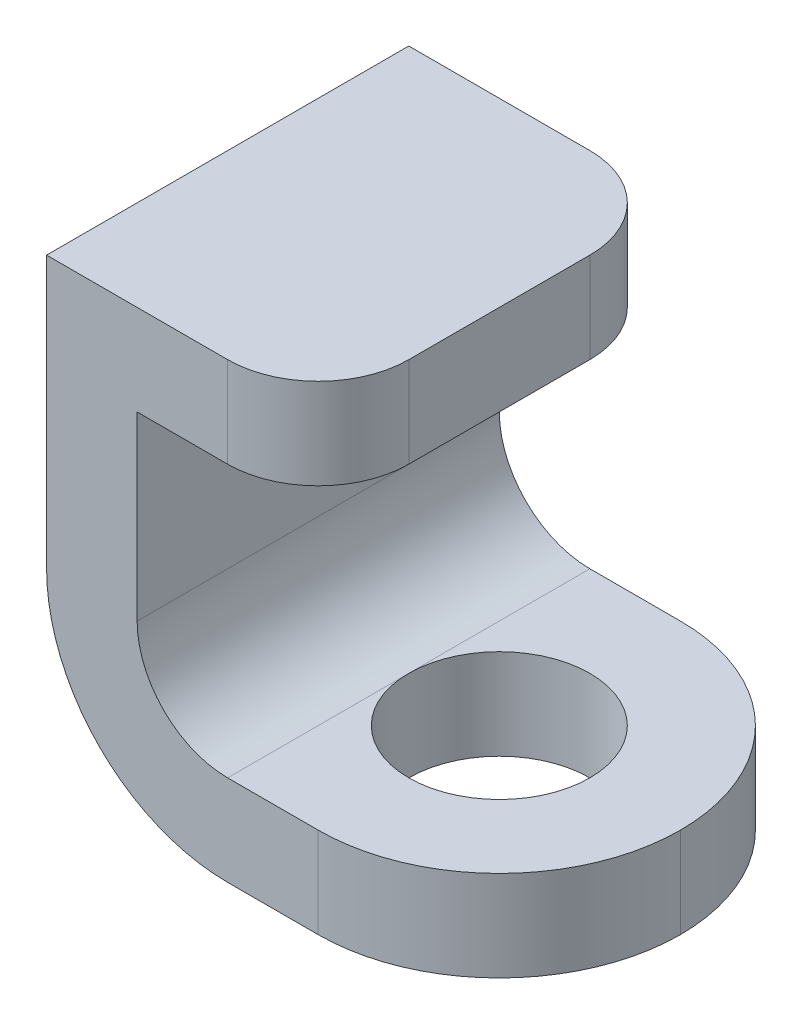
ISO-10303-21;
HEADER;
FILE_DESCRIPTION(('STEP AP214'),'2;1');
FILE_NAME('part.step','',(''),(''),'','','');
FILE_SCHEMA(('AUTOMOTIVE_DESIGN { 1 0 10303 214 1 1 1 1 }'));
ENDSEC;
DATA;
#1=APPLICATION_CONTEXT('core data for automotive mechanical design processes');
#2=APPLICATION_PROTOCOL_DEFINITION('international standard','automotive_design',2000,#1);
#3=PRODUCT_CONTEXT('',#1,'mechanical');
#4=PRODUCT('Part','Part','',(#3));
#5=PRODUCT_RELATED_PRODUCT_CATEGORY('part','',(#4));
#6=PRODUCT_DEFINITION_FORMATION('','',#4);
#7=PRODUCT_DEFINITION_CONTEXT('part definition',#1,'design');
#8=PRODUCT_DEFINITION('design','',#6,#7);
#9=PRODUCT_DEFINITION_SHAPE('','',#8);
#10=(LENGTH_UNIT() NAMED_UNIT(*) SI_UNIT(.MILLI.,.METRE.));
#11=(NAMED_UNIT(*) PLANE_ANGLE_UNIT() SI_UNIT($,.RADIAN.));
#12=(NAMED_UNIT(*) SI_UNIT($,.STERADIAN.) SOLID_ANGLE_UNIT());
#13=UNCERTAINTY_MEASURE_WITH_UNIT(LENGTH_MEASURE(1.E-05),#10,'distance_accuracy_value','');
#14=(GEOMETRIC_REPRESENTATION_CONTEXT(3) GLOBAL_UNCERTAINTY_ASSIGNED_CONTEXT((#13)) GLOBAL_UNIT_ASSIGNED_CONTEXT((#10,
#11,#12)) REPRESENTATION_CONTEXT('',''));
#15=CARTESIAN_POINT('',(0.,0.,0.));
#16=DIRECTION('',(0.,0.,1.));
#17=DIRECTION('',(1.,0.,0.));
#18=AXIS2_PLACEMENT_3D('',#15,#16,#17);
#19=CARTESIAN_POINT('',(-50.,40.,20.));
#20=DIRECTION('',(0.,1.,0.));
#21=DIRECTION('',(0.,0.,1.));
#22=AXIS2_PLACEMENT_3D('',#19,#20,#21);
#23=PLANE('',#22);
#24=DIRECTION('',(1.,0.,0.));
#25=VECTOR('',#24,1.);
#26=CARTESIAN_POINT('',(-50.,40.,-20.));
#27=LINE('',#26,#25);
#28=CARTESIAN_POINT('',(-40.,40.,-20.));
#29=VERTEX_POINT('',#28);
#30=CARTESIAN_POINT('',(-30.,40.,-20.));
#31=VERTEX_POINT('',#30);
#32=EDGE_CURVE('E171',#29,#31,#27,.T.);
#33=ORIENTED_EDGE('',*,*,#32,.T.);
#34=CARTESIAN_POINT('',(-30.,40.,-10.));
#35=DIRECTION('',(0.,1.,0.));
#36=DIRECTION('',(0.,0.,1.));
#37=AXIS2_PLACEMENT_3D('',#34,#35,#36);
#38=CIRCLE('',#37,10.);
#39=CARTESIAN_POINT('',(-20.,40.,-10.));
#40=VERTEX_POINT('',#39);
#41=EDGE_CURVE('E213',#31,#40,#38,.F.);
#42=ORIENTED_EDGE('',*,*,#41,.T.);
#43=DIRECTION('',(0.,0.,-1.));
#44=VECTOR('',#43,1.);
#45=CARTESIAN_POINT('',(-20.,40.,20.));
#46=LINE('',#45,#44);
#47=CARTESIAN_POINT('',(-20.,40.,10.));
#48=VERTEX_POINT('',#47);
#49=EDGE_CURVE('E205',#48,#40,#46,.T.);
#50=ORIENTED_EDGE('',*,*,#49,.F.);
#51=CARTESIAN_POINT('',(-30.,40.,10.));
#52=DIRECTION('',(0.,1.,0.));
#53=DIRECTION('',(0.,0.,1.));
#54=AXIS2_PLACEMENT_3D('',#51,#52,#53);
#55=CIRCLE('',#54,10.);
#56=CARTESIAN_POINT('',(-30.,40.,20.));
#57=VERTEX_POINT('',#56);
#58=EDGE_CURVE('E211',#48,#57,#55,.F.);
#59=ORIENTED_EDGE('',*,*,#58,.T.);
#60=DIRECTION('',(1.,0.,0.));
#61=VECTOR('',#60,1.);
#62=CARTESIAN_POINT('',(-50.,40.,20.));
#63=LINE('',#62,#61);
#64=CARTESIAN_POINT('',(-40.,40.,20.));
#65=VERTEX_POINT('',#64);
#66=EDGE_CURVE('E154',#65,#57,#63,.T.);
#67=ORIENTED_EDGE('',*,*,#66,.F.);
#68=DIRECTION('',(0.,0.,-1.));
#69=VECTOR('',#68,1.);
#70=CARTESIAN_POINT('',(-40.,40.,20.));
#71=LINE('',#70,#69);
#72=EDGE_CURVE('E170',#65,#29,#71,.T.);
#73=ORIENTED_EDGE('',*,*,#72,.T.);
#74=EDGE_LOOP('',(#33,#42,#50,#59,#67,#73));
#75=FACE_BOUND('',#74,.T.);
#76=ADVANCED_FACE('F30',(#75),#23,.F.);
#77=CARTESIAN_POINT('',(-20.,50.,20.));
#78=DIRECTION('',(1.,0.,0.));
#79=DIRECTION('',(0.,0.,-1.));
#80=AXIS2_PLACEMENT_3D('',#77,#78,#79);
#81=PLANE('',#80);
#82=ORIENTED_EDGE('',*,*,#49,.T.);
#83=DIRECTION('',(0.,-1.,0.));
#84=VECTOR('',#83,1.);
#85=CARTESIAN_POINT('',(-20.,50.,-10.));
#86=LINE('',#85,#84);
#87=CARTESIAN_POINT('',(-20.,50.,-10.));
#88=VERTEX_POINT('',#87);
#89=EDGE_CURVE('E218',#40,#88,#86,.F.);
#90=ORIENTED_EDGE('',*,*,#89,.T.);
#91=DIRECTION('',(0.,0.,-1.));
#92=VECTOR('',#91,1.);
#93=CARTESIAN_POINT('',(-20.,50.,20.));
#94=LINE('',#93,#92);
#95=CARTESIAN_POINT('',(-20.,50.,10.));
#96=VERTEX_POINT('',#95);
#97=EDGE_CURVE('E141',#96,#88,#94,.T.);
#98=ORIENTED_EDGE('',*,*,#97,.F.);
#99=DIRECTION('',(0.,-1.,0.));
#100=VECTOR('',#99,1.);
#101=CARTESIAN_POINT('',(-20.,40.,10.));
#102=LINE('',#101,#100);
#103=EDGE_CURVE('E215',#96,#48,#102,.T.);
#104=ORIENTED_EDGE('',*,*,#103,.T.);
#105=EDGE_LOOP('',(#82,#90,#98,#104));
#106=FACE_BOUND('',#105,.T.);
#107=ADVANCED_FACE('F276',(#106),#81,.T.);
#108=CARTESIAN_POINT('',(-50.,50.,20.));
#109=DIRECTION('',(0.,1.,0.));
#110=DIRECTION('',(0.,0.,1.));
#111=AXIS2_PLACEMENT_3D('',#108,#109,#110);
#112=PLANE('',#111);
#113=ORIENTED_EDGE('',*,*,#97,.T.);
#114=CARTESIAN_POINT('',(-30.,50.,-10.));
#115=DIRECTION('',(0.,1.,0.));
#116=DIRECTION('',(0.,0.,1.));
#117=AXIS2_PLACEMENT_3D('',#114,#115,#116);
#118=CIRCLE('',#117,10.);
#119=CARTESIAN_POINT('',(-30.,50.,-20.));
#120=VERTEX_POINT('',#119);
#121=EDGE_CURVE('E222',#88,#120,#118,.T.);
#122=ORIENTED_EDGE('',*,*,#121,.T.);
#123=DIRECTION('',(1.,0.,0.));
#124=VECTOR('',#123,1.);
#125=CARTESIAN_POINT('',(-50.,50.,-20.));
#126=LINE('',#125,#124);
#127=CARTESIAN_POINT('',(-50.,50.,-20.));
#128=VERTEX_POINT('',#127);
#129=EDGE_CURVE('E136',#128,#120,#126,.T.);
#130=ORIENTED_EDGE('',*,*,#129,.F.);
#131=DIRECTION('',(0.,0.,-1.));
#132=VECTOR('',#131,1.);
#133=CARTESIAN_POINT('',(-50.,50.,20.));
#134=LINE('',#133,#132);
#135=CARTESIAN_POINT('',(-50.,50.,20.));
#136=VERTEX_POINT('',#135);
#137=EDGE_CURVE('E129',#136,#128,#134,.T.);
#138=ORIENTED_EDGE('',*,*,#137,.F.);
#139=DIRECTION('',(1.,0.,0.));
#140=VECTOR('',#139,1.);
#141=CARTESIAN_POINT('',(-50.,50.,20.));
#142=LINE('',#141,#140);
#143=CARTESIAN_POINT('',(-30.,50.,20.));
#144=VERTEX_POINT('',#143);
#145=EDGE_CURVE('E133',#136,#144,#142,.T.);
#146=ORIENTED_EDGE('',*,*,#145,.T.);
#147=CARTESIAN_POINT('',(-30.,50.,10.));
#148=DIRECTION('',(0.,1.,0.));
#149=DIRECTION('',(0.,0.,1.));
#150=AXIS2_PLACEMENT_3D('',#147,#148,#149);
#151=CIRCLE('',#150,10.);
#152=EDGE_CURVE('E220',#144,#96,#151,.T.);
#153=ORIENTED_EDGE('',*,*,#152,.T.);
#154=EDGE_LOOP('',(#113,#122,#130,#138,#146,#153));
#155=FACE_BOUND('',#154,.T.);
#156=ADVANCED_FACE('F132',(#155),#112,.T.);
#157=CARTESIAN_POINT('',(-50.,20.,20.));
#158=DIRECTION('',(-1.,0.,0.));
#159=DIRECTION('',(0.,0.,1.));
#160=AXIS2_PLACEMENT_3D('',#157,#158,#159);
#161=PLANE('',#160);
#162=DIRECTION('',(0.,1.,0.));
#163=VECTOR('',#162,1.);
#164=CARTESIAN_POINT('',(-50.,20.,-20.));
#165=LINE('',#164,#163);
#166=CARTESIAN_POINT('',(-50.,20.,-20.));
#167=VERTEX_POINT('',#166);
#168=EDGE_CURVE('E175',#167,#128,#165,.T.);
#169=ORIENTED_EDGE('',*,*,#168,.F.);
#170=DIRECTION('',(0.,0.,-1.));
#171=VECTOR('',#170,1.);
#172=CARTESIAN_POINT('',(-50.,20.,20.));
#173=LINE('',#172,#171);
#174=CARTESIAN_POINT('',(-50.,20.,20.));
#175=VERTEX_POINT('',#174);
#176=EDGE_CURVE('E142',#175,#167,#173,.T.);
#177=ORIENTED_EDGE('',*,*,#176,.F.);
#178=DIRECTION('',(0.,1.,0.));
#179=VECTOR('',#178,1.);
#180=CARTESIAN_POINT('',(-50.,20.,20.));
#181=LINE('',#180,#179);
#182=EDGE_CURVE('E149',#175,#136,#181,.T.);
#183=ORIENTED_EDGE('',*,*,#182,.T.);
#184=ORIENTED_EDGE('',*,*,#137,.T.);
#185=EDGE_LOOP('',(#169,#177,#183,#184));
#186=FACE_BOUND('',#185,.T.);
#187=ADVANCED_FACE('F156',(#186),#161,.T.);
#188=CARTESIAN_POINT('',(-30.,20.,20.));
#189=DIRECTION('',(0.,0.,-1.));
#190=DIRECTION('',(-1.,0.,0.));
#191=AXIS2_PLACEMENT_3D('',#188,#189,#190);
#192=CYLINDRICAL_SURFACE('',#191,20.);
#193=CARTESIAN_POINT('',(-30.,20.,-20.));
#194=DIRECTION('',(0.,0.,-1.));
#195=DIRECTION('',(-1.,0.,0.));
#196=AXIS2_PLACEMENT_3D('',#193,#194,#195);
#197=CIRCLE('',#196,20.);
#198=CARTESIAN_POINT('',(-30.,0.,-20.));
#199=VERTEX_POINT('',#198);
#200=EDGE_CURVE('E177',#199,#167,#197,.T.);
#201=ORIENTED_EDGE('',*,*,#200,.F.);
#202=DIRECTION('',(0.,0.,-1.));
#203=VECTOR('',#202,1.);
#204=CARTESIAN_POINT('',(-30.,0.,20.));
#205=LINE('',#204,#203);
#206=CARTESIAN_POINT('',(-30.,0.,0.));
#207=VERTEX_POINT('',#206);
#208=EDGE_CURVE('E199',#207,#199,#205,.T.);
#209=ORIENTED_EDGE('',*,*,#208,.F.);
#210=CARTESIAN_POINT('',(-30.,0.,20.));
#211=VERTEX_POINT('',#210);
#212=EDGE_CURVE('E200',#211,#207,#205,.T.);
#213=ORIENTED_EDGE('',*,*,#212,.F.);
#214=CARTESIAN_POINT('',(-30.,20.,20.));
#215=DIRECTION('',(0.,0.,-1.));
#216=DIRECTION('',(-1.,0.,0.));
#217=AXIS2_PLACEMENT_3D('',#214,#215,#216);
#218=CIRCLE('',#217,20.);
#219=EDGE_CURVE('E157',#211,#175,#218,.T.);
#220=ORIENTED_EDGE('',*,*,#219,.T.);
#221=ORIENTED_EDGE('',*,*,#176,.T.);
#222=EDGE_LOOP('',(#201,#209,#213,#220,#221));
#223=FACE_BOUND('',#222,.T.);
#224=ADVANCED_FACE('F285',(#223),#192,.T.);
#225=CARTESIAN_POINT('',(0.,0.,20.));
#226=DIRECTION('',(0.,-1.,0.));
#227=DIRECTION('',(0.,0.,-1.));
#228=AXIS2_PLACEMENT_3D('',#225,#226,#227);
#229=PLANE('',#228);
#230=ORIENTED_EDGE('',*,*,#212,.T.);
#231=CARTESIAN_POINT('',(-20.,0.,0.));
#232=DIRECTION('',(0.,-1.,0.));
#233=DIRECTION('',(0.,0.,-1.));
#234=AXIS2_PLACEMENT_3D('',#231,#232,#233);
#235=CIRCLE('',#234,10.);
#236=EDGE_CURVE('E44',#207,#207,#235,.T.);
#237=ORIENTED_EDGE('',*,*,#236,.F.);
#238=ORIENTED_EDGE('',*,*,#208,.T.);
#239=DIRECTION('',(-1.,0.,0.));
#240=VECTOR('',#239,1.);
#241=CARTESIAN_POINT('',(0.,0.,-20.));
#242=LINE('',#241,#240);
#243=CARTESIAN_POINT('',(-20.,0.,-20.));
#244=VERTEX_POINT('',#243);
#245=EDGE_CURVE('E180',#244,#199,#242,.T.);
#246=ORIENTED_EDGE('',*,*,#245,.F.);
#247=CARTESIAN_POINT('',(-20.,0.,0.));
#248=DIRECTION('',(0.,-1.,0.));
#249=DIRECTION('',(0.,0.,-1.));
#250=AXIS2_PLACEMENT_3D('',#247,#248,#249);
#251=CIRCLE('',#250,20.);
#252=CARTESIAN_POINT('',(0.,0.,0.));
#253=VERTEX_POINT('',#252);
#254=EDGE_CURVE('E230',#244,#253,#251,.T.);
#255=ORIENTED_EDGE('',*,*,#254,.T.);
#256=CARTESIAN_POINT('',(-20.,0.,0.));
#257=DIRECTION('',(0.,-1.,0.));
#258=DIRECTION('',(0.,0.,-1.));
#259=AXIS2_PLACEMENT_3D('',#256,#257,#258);
#260=CIRCLE('',#259,20.);
#261=CARTESIAN_POINT('',(-20.,0.,20.));
#262=VERTEX_POINT('',#261);
#263=EDGE_CURVE('E228',#253,#262,#260,.T.);
#264=ORIENTED_EDGE('',*,*,#263,.T.);
#265=DIRECTION('',(-1.,0.,0.));
#266=VECTOR('',#265,1.);
#267=CARTESIAN_POINT('',(0.,0.,20.));
#268=LINE('',#267,#266);
#269=EDGE_CURVE('E159',#262,#211,#268,.T.);
#270=ORIENTED_EDGE('',*,*,#269,.T.);
#271=EDGE_LOOP('',(#230,#237,#238,#246,#255,#264,#270));
#272=FACE_BOUND('',#271,.T.);
#273=ADVANCED_FACE('F253',(#272),#229,.T.);
#274=CARTESIAN_POINT('',(0.,10.,20.));
#275=DIRECTION('',(0.,-1.,0.));
#276=DIRECTION('',(0.,0.,-1.));
#277=AXIS2_PLACEMENT_3D('',#274,#275,#276);
#278=PLANE('',#277);
#279=DIRECTION('',(0.,0.,-1.));
#280=VECTOR('',#279,1.);
#281=CARTESIAN_POINT('',(-30.,10.,20.));
#282=LINE('',#281,#280);
#283=CARTESIAN_POINT('',(-30.,10.,0.));
#284=VERTEX_POINT('',#283);
#285=CARTESIAN_POINT('',(-30.,10.,-20.));
#286=VERTEX_POINT('',#285);
#287=EDGE_CURVE('E195',#284,#286,#282,.T.);
#288=ORIENTED_EDGE('',*,*,#287,.F.);
#289=CARTESIAN_POINT('',(-20.,10.,0.));
#290=DIRECTION('',(0.,-1.,0.));
#291=DIRECTION('',(0.,0.,-1.));
#292=AXIS2_PLACEMENT_3D('',#289,#290,#291);
#293=CIRCLE('',#292,10.);
#294=EDGE_CURVE('E49',#284,#284,#293,.T.);
#295=ORIENTED_EDGE('',*,*,#294,.T.);
#296=CARTESIAN_POINT('',(-30.,10.,20.));
#297=VERTEX_POINT('',#296);
#298=EDGE_CURVE('E196',#297,#284,#282,.T.);
#299=ORIENTED_EDGE('',*,*,#298,.F.);
#300=DIRECTION('',(1.,0.,0.));
#301=VECTOR('',#300,1.);
#302=CARTESIAN_POINT('',(0.,10.,20.));
#303=LINE('',#302,#301);
#304=CARTESIAN_POINT('',(-20.,10.,20.));
#305=VERTEX_POINT('',#304);
#306=EDGE_CURVE('E164',#305,#297,#303,.F.);
#307=ORIENTED_EDGE('',*,*,#306,.F.);
#308=CARTESIAN_POINT('',(-20.,10.,0.));
#309=DIRECTION('',(0.,-1.,0.));
#310=DIRECTION('',(0.,0.,-1.));
#311=AXIS2_PLACEMENT_3D('',#308,#309,#310);
#312=CIRCLE('',#311,20.);
#313=CARTESIAN_POINT('',(0.,10.,0.));
#314=VERTEX_POINT('',#313);
#315=EDGE_CURVE('E232',#305,#314,#312,.F.);
#316=ORIENTED_EDGE('',*,*,#315,.T.);
#317=CARTESIAN_POINT('',(-20.,10.,0.));
#318=DIRECTION('',(0.,-1.,0.));
#319=DIRECTION('',(0.,0.,-1.));
#320=AXIS2_PLACEMENT_3D('',#317,#318,#319);
#321=CIRCLE('',#320,20.);
#322=CARTESIAN_POINT('',(-20.,10.,-20.));
#323=VERTEX_POINT('',#322);
#324=EDGE_CURVE('E39',#314,#323,#321,.F.);
#325=ORIENTED_EDGE('',*,*,#324,.T.);
#326=DIRECTION('',(1.,0.,0.));
#327=VECTOR('',#326,1.);
#328=CARTESIAN_POINT('',(0.,10.,-20.));
#329=LINE('',#328,#327);
#330=EDGE_CURVE('E183',#323,#286,#329,.F.);
#331=ORIENTED_EDGE('',*,*,#330,.T.);
#332=EDGE_LOOP('',(#288,#295,#299,#307,#316,#325,#331));
#333=FACE_BOUND('',#332,.T.);
#334=ADVANCED_FACE('F238',(#333),#278,.F.);
#335=CARTESIAN_POINT('',(-30.,20.,20.));
#336=DIRECTION('',(0.,0.,-1.));
#337=DIRECTION('',(-1.,0.,0.));
#338=AXIS2_PLACEMENT_3D('',#335,#336,#337);
#339=CYLINDRICAL_SURFACE('',#338,10.);
#340=CARTESIAN_POINT('',(-30.,20.,-20.));
#341=DIRECTION('',(0.,0.,1.));
#342=DIRECTION('',(1.,0.,0.));
#343=AXIS2_PLACEMENT_3D('',#340,#341,#342);
#344=CIRCLE('',#343,10.);
#345=CARTESIAN_POINT('',(-40.,20.,-20.));
#346=VERTEX_POINT('',#345);
#347=EDGE_CURVE('E186',#286,#346,#344,.F.);
#348=ORIENTED_EDGE('',*,*,#347,.T.);
#349=DIRECTION('',(0.,0.,-1.));
#350=VECTOR('',#349,1.);
#351=CARTESIAN_POINT('',(-40.,20.,20.));
#352=LINE('',#351,#350);
#353=CARTESIAN_POINT('',(-40.,20.,20.));
#354=VERTEX_POINT('',#353);
#355=EDGE_CURVE('E192',#354,#346,#352,.T.);
#356=ORIENTED_EDGE('',*,*,#355,.F.);
#357=CARTESIAN_POINT('',(-30.,20.,20.));
#358=DIRECTION('',(0.,0.,1.));
#359=DIRECTION('',(1.,0.,0.));
#360=AXIS2_PLACEMENT_3D('',#357,#358,#359);
#361=CIRCLE('',#360,10.);
#362=EDGE_CURVE('E166',#297,#354,#361,.F.);
#363=ORIENTED_EDGE('',*,*,#362,.F.);
#364=ORIENTED_EDGE('',*,*,#298,.T.);
#365=ORIENTED_EDGE('',*,*,#287,.T.);
#366=EDGE_LOOP('',(#348,#356,#363,#364,#365));
#367=FACE_BOUND('',#366,.T.);
#368=ADVANCED_FACE('F260',(#367),#339,.F.);
#369=CARTESIAN_POINT('',(-40.,20.,20.));
#370=DIRECTION('',(-1.,0.,0.));
#371=DIRECTION('',(0.,0.,1.));
#372=AXIS2_PLACEMENT_3D('',#369,#370,#371);
#373=PLANE('',#372);
#374=DIRECTION('',(0.,1.,0.));
#375=VECTOR('',#374,1.);
#376=CARTESIAN_POINT('',(-40.,20.,-20.));
#377=LINE('',#376,#375);
#378=EDGE_CURVE('E188',#346,#29,#377,.T.);
#379=ORIENTED_EDGE('',*,*,#378,.T.);
#380=ORIENTED_EDGE('',*,*,#72,.F.);
#381=DIRECTION('',(0.,1.,0.));
#382=VECTOR('',#381,1.);
#383=CARTESIAN_POINT('',(-40.,20.,20.));
#384=LINE('',#383,#382);
#385=EDGE_CURVE('E168',#354,#65,#384,.T.);
#386=ORIENTED_EDGE('',*,*,#385,.F.);
#387=ORIENTED_EDGE('',*,*,#355,.T.);
#388=EDGE_LOOP('',(#379,#380,#386,#387));
#389=FACE_BOUND('',#388,.T.);
#390=ADVANCED_FACE('F265',(#389),#373,.F.);
#391=CARTESIAN_POINT('',(-30.,20.,20.));
#392=DIRECTION('',(0.,0.,-1.));
#393=DIRECTION('',(-1.,0.,0.));
#394=AXIS2_PLACEMENT_3D('',#391,#392,#393);
#395=PLANE('',#394);
#396=ORIENTED_EDGE('',*,*,#269,.F.);
#397=DIRECTION('',(0.,-1.,0.));
#398=VECTOR('',#397,1.);
#399=CARTESIAN_POINT('',(-20.,10.,20.));
#400=LINE('',#399,#398);
#401=EDGE_CURVE('E11',#262,#305,#400,.F.);
#402=ORIENTED_EDGE('',*,*,#401,.T.);
#403=ORIENTED_EDGE('',*,*,#306,.T.);
#404=ORIENTED_EDGE('',*,*,#362,.T.);
#405=ORIENTED_EDGE('',*,*,#385,.T.);
#406=ORIENTED_EDGE('',*,*,#66,.T.);
#407=DIRECTION('',(0.,-1.,0.));
#408=VECTOR('',#407,1.);
#409=CARTESIAN_POINT('',(-30.,50.,20.));
#410=LINE('',#409,#408);
#411=EDGE_CURVE('E153',#57,#144,#410,.F.);
#412=ORIENTED_EDGE('',*,*,#411,.T.);
#413=ORIENTED_EDGE('',*,*,#145,.F.);
#414=ORIENTED_EDGE('',*,*,#182,.F.);
#415=ORIENTED_EDGE('',*,*,#219,.F.);
#416=EDGE_LOOP('',(#396,#402,#403,#404,#405,#406,#412,#413,#414,#415));
#417=FACE_BOUND('',#416,.T.);
#418=ADVANCED_FACE('F147',(#417),#395,.F.);
#419=CARTESIAN_POINT('',(-30.,20.,-20.));
#420=DIRECTION('',(0.,0.,-1.));
#421=DIRECTION('',(-1.,0.,0.));
#422=AXIS2_PLACEMENT_3D('',#419,#420,#421);
#423=PLANE('',#422);
#424=ORIENTED_EDGE('',*,*,#330,.F.);
#425=DIRECTION('',(0.,-1.,0.));
#426=VECTOR('',#425,1.);
#427=CARTESIAN_POINT('',(-20.,20.,-20.));
#428=LINE('',#427,#426);
#429=EDGE_CURVE('E225',#323,#244,#428,.T.);
#430=ORIENTED_EDGE('',*,*,#429,.T.);
#431=ORIENTED_EDGE('',*,*,#245,.T.);
#432=ORIENTED_EDGE('',*,*,#200,.T.);
#433=ORIENTED_EDGE('',*,*,#168,.T.);
#434=ORIENTED_EDGE('',*,*,#129,.T.);
#435=DIRECTION('',(0.,-1.,0.));
#436=VECTOR('',#435,1.);
#437=CARTESIAN_POINT('',(-30.,20.,-20.));
#438=LINE('',#437,#436);
#439=EDGE_CURVE('E208',#120,#31,#438,.T.);
#440=ORIENTED_EDGE('',*,*,#439,.T.);
#441=ORIENTED_EDGE('',*,*,#32,.F.);
#442=ORIENTED_EDGE('',*,*,#378,.F.);
#443=ORIENTED_EDGE('',*,*,#347,.F.);
#444=EDGE_LOOP('',(#424,#430,#431,#432,#433,#434,#440,#441,#442,#443));
#445=FACE_BOUND('',#444,.T.);
#446=ADVANCED_FACE('F247',(#445),#423,.T.);
#447=CARTESIAN_POINT('',(-30.,20.,-10.));
#448=DIRECTION('',(0.,-1.,0.));
#449=DIRECTION('',(0.,0.,-1.));
#450=AXIS2_PLACEMENT_3D('',#447,#448,#449);
#451=CYLINDRICAL_SURFACE('',#450,10.);
#452=ORIENTED_EDGE('',*,*,#121,.F.);
#453=ORIENTED_EDGE('',*,*,#89,.F.);
#454=ORIENTED_EDGE('',*,*,#41,.F.);
#455=ORIENTED_EDGE('',*,*,#439,.F.);
#456=EDGE_LOOP('',(#452,#453,#454,#455));
#457=FACE_BOUND('',#456,.T.);
#458=ADVANCED_FACE('F281',(#457),#451,.T.);
#459=CARTESIAN_POINT('',(-30.,50.,10.));
#460=DIRECTION('',(0.,1.,0.));
#461=DIRECTION('',(0.,0.,1.));
#462=AXIS2_PLACEMENT_3D('',#459,#460,#461);
#463=CYLINDRICAL_SURFACE('',#462,10.);
#464=ORIENTED_EDGE('',*,*,#152,.F.);
#465=ORIENTED_EDGE('',*,*,#411,.F.);
#466=ORIENTED_EDGE('',*,*,#58,.F.);
#467=ORIENTED_EDGE('',*,*,#103,.F.);
#468=EDGE_LOOP('',(#464,#465,#466,#467));
#469=FACE_BOUND('',#468,.T.);
#470=ADVANCED_FACE('F273',(#469),#463,.T.);
#471=CARTESIAN_POINT('',(-20.,10.,0.));
#472=DIRECTION('',(0.,1.,0.));
#473=DIRECTION('',(0.,0.,1.));
#474=AXIS2_PLACEMENT_3D('',#471,#472,#473);
#475=CYLINDRICAL_SURFACE('',#474,20.);
#476=DIRECTION('',(0.,-1.,0.));
#477=VECTOR('',#476,1.);
#478=CARTESIAN_POINT('',(0.,0.,0.));
#479=LINE('',#478,#477);
#480=EDGE_CURVE('E34',#314,#253,#479,.T.);
#481=ORIENTED_EDGE('',*,*,#480,.F.);
#482=ORIENTED_EDGE('',*,*,#315,.F.);
#483=ORIENTED_EDGE('',*,*,#401,.F.);
#484=ORIENTED_EDGE('',*,*,#263,.F.);
#485=EDGE_LOOP('',(#481,#482,#483,#484));
#486=FACE_BOUND('',#485,.T.);
#487=ADVANCED_FACE('F32',(#486),#475,.T.);
#488=CARTESIAN_POINT('',(-20.,20.,0.));
#489=DIRECTION('',(0.,-1.,0.));
#490=DIRECTION('',(0.,0.,-1.));
#491=AXIS2_PLACEMENT_3D('',#488,#489,#490);
#492=CYLINDRICAL_SURFACE('',#491,20.);
#493=ORIENTED_EDGE('',*,*,#324,.F.);
#494=ORIENTED_EDGE('',*,*,#480,.T.);
#495=ORIENTED_EDGE('',*,*,#254,.F.);
#496=ORIENTED_EDGE('',*,*,#429,.F.);
#497=EDGE_LOOP('',(#493,#494,#495,#496));
#498=FACE_BOUND('',#497,.T.);
#499=ADVANCED_FACE('F250',(#498),#492,.T.);
#500=CARTESIAN_POINT('',(-20.,10.,0.));
#501=DIRECTION('',(0.,-1.,0.));
#502=DIRECTION('',(0.,0.,-1.));
#503=AXIS2_PLACEMENT_3D('',#500,#501,#502);
#504=CYLINDRICAL_SURFACE('',#503,10.);
#505=ORIENTED_EDGE('',*,*,#294,.F.);
#506=EDGE_LOOP('',(#505));
#507=FACE_BOUND('',#506,.T.);
#508=ORIENTED_EDGE('',*,*,#236,.T.);
#509=EDGE_LOOP('',(#508));
#510=FACE_BOUND('',#509,.T.);
#511=ADVANCED_FACE('F307',(#507,#510),#504,.F.);
#512=CLOSED_SHELL('',(#76,#107,#156,#187,#224,#273,#334,#368,#390,#418,#446,#458,#470,#487,#499,#511));
#513=MANIFOLD_SOLID_BREP('B2',#512);
#514=ADVANCED_BREP_SHAPE_REPRESENTATION('',(#18,#513),#14);
#515=SHAPE_DEFINITION_REPRESENTATION(#9,#514);
ENDSEC;
END-ISO-10303-21;
